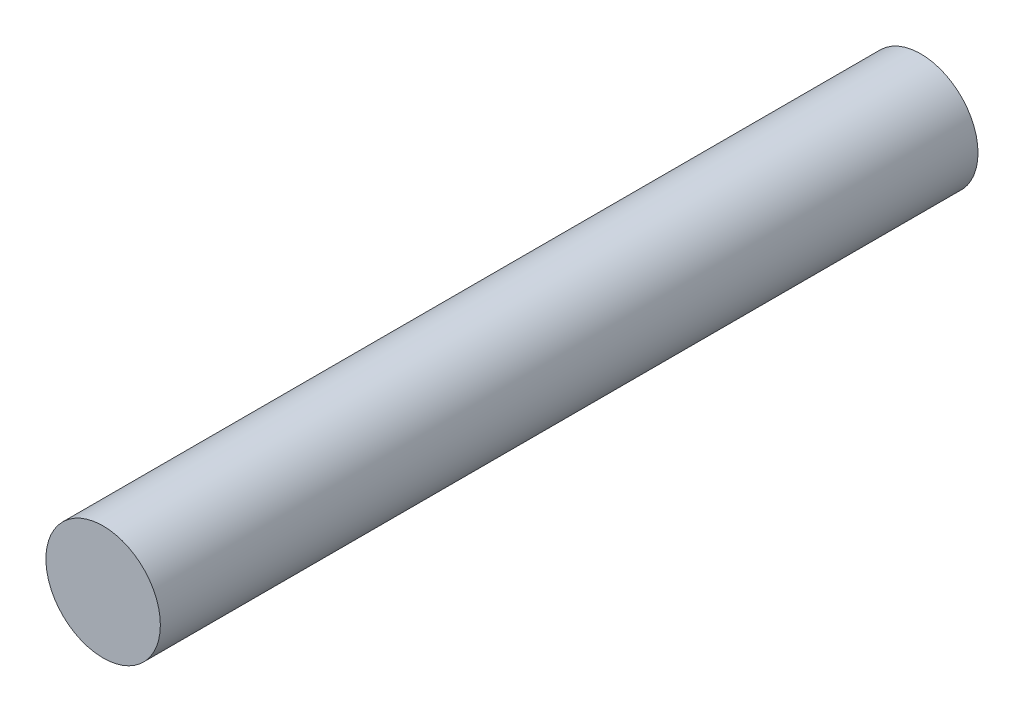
ISO-10303-21;
HEADER;
FILE_DESCRIPTION(('STEP AP214'),'2;1');
FILE_NAME('part.step','',(''),(''),'','','');
FILE_SCHEMA(('AUTOMOTIVE_DESIGN { 1 0 10303 214 1 1 1 1 }'));
ENDSEC;
DATA;
#1=APPLICATION_CONTEXT('core data for automotive mechanical design processes');
#2=APPLICATION_PROTOCOL_DEFINITION('international standard','automotive_design',2000,#1);
#3=PRODUCT_CONTEXT('',#1,'mechanical');
#4=PRODUCT('Part','Part','',(#3));
#5=PRODUCT_RELATED_PRODUCT_CATEGORY('part','',(#4));
#6=PRODUCT_DEFINITION_FORMATION('','',#4);
#7=PRODUCT_DEFINITION_CONTEXT('part definition',#1,'design');
#8=PRODUCT_DEFINITION('design','',#6,#7);
#9=PRODUCT_DEFINITION_SHAPE('','',#8);
#10=(LENGTH_UNIT() NAMED_UNIT(*) SI_UNIT(.MILLI.,.METRE.));
#11=(NAMED_UNIT(*) PLANE_ANGLE_UNIT() SI_UNIT($,.RADIAN.));
#12=(NAMED_UNIT(*) SI_UNIT($,.STERADIAN.) SOLID_ANGLE_UNIT());
#13=UNCERTAINTY_MEASURE_WITH_UNIT(LENGTH_MEASURE(1.E-05),#10,'distance_accuracy_value','');
#14=(GEOMETRIC_REPRESENTATION_CONTEXT(3) GLOBAL_UNCERTAINTY_ASSIGNED_CONTEXT((#13)) GLOBAL_UNIT_ASSIGNED_CONTEXT((#10,
#11,#12)) REPRESENTATION_CONTEXT('',''));
#15=CARTESIAN_POINT('',(0.,0.,0.));
#16=DIRECTION('',(0.,0.,1.));
#17=DIRECTION('',(1.,0.,0.));
#18=AXIS2_PLACEMENT_3D('',#15,#16,#17);
#19=CARTESIAN_POINT('',(0.,0.,750.));
#20=DIRECTION('',(0.,0.,-1.));
#21=DIRECTION('',(-1.,0.,0.));
#22=AXIS2_PLACEMENT_3D('',#19,#20,#21);
#23=CYLINDRICAL_SURFACE('',#22,52.5);
#24=CARTESIAN_POINT('',(0.,0.,750.));
#25=DIRECTION('',(0.,0.,1.));
#26=DIRECTION('',(1.,0.,0.));
#27=AXIS2_PLACEMENT_3D('',#24,#25,#26);
#28=CIRCLE('',#27,52.5);
#29=CARTESIAN_POINT('',(52.5,0.,750.));
#30=VERTEX_POINT('',#29);
#31=EDGE_CURVE('E10',#30,#30,#28,.T.);
#32=ORIENTED_EDGE('',*,*,#31,.F.);
#33=EDGE_LOOP('',(#32));
#34=FACE_BOUND('',#33,.T.);
#35=CARTESIAN_POINT('',(0.,0.,0.));
#36=DIRECTION('',(0.,0.,1.));
#37=DIRECTION('',(1.,0.,0.));
#38=AXIS2_PLACEMENT_3D('',#35,#36,#37);
#39=CIRCLE('',#38,52.5);
#40=CARTESIAN_POINT('',(52.5,0.,0.));
#41=VERTEX_POINT('',#40);
#42=EDGE_CURVE('E34',#41,#41,#39,.T.);
#43=ORIENTED_EDGE('',*,*,#42,.T.);
#44=EDGE_LOOP('',(#43));
#45=FACE_BOUND('',#44,.T.);
#46=ADVANCED_FACE('F31',(#34,#45),#23,.T.);
#47=CARTESIAN_POINT('',(0.,0.,750.));
#48=DIRECTION('',(0.,0.,1.));
#49=DIRECTION('',(1.,0.,0.));
#50=AXIS2_PLACEMENT_3D('',#47,#48,#49);
#51=PLANE('',#50);
#52=ORIENTED_EDGE('',*,*,#31,.T.);
#53=EDGE_LOOP('',(#52));
#54=FACE_BOUND('',#53,.T.);
#55=ADVANCED_FACE('F46',(#54),#51,.T.);
#56=CARTESIAN_POINT('',(0.,0.,0.));
#57=DIRECTION('',(0.,0.,1.));
#58=DIRECTION('',(1.,0.,0.));
#59=AXIS2_PLACEMENT_3D('',#56,#57,#58);
#60=PLANE('',#59);
#61=ORIENTED_EDGE('',*,*,#42,.F.);
#62=EDGE_LOOP('',(#61));
#63=FACE_BOUND('',#62,.T.);
#64=ADVANCED_FACE('F44',(#63),#60,.F.);
#65=CLOSED_SHELL('',(#46,#55,#64));
#66=MANIFOLD_SOLID_BREP('B2',#65);
#67=ADVANCED_BREP_SHAPE_REPRESENTATION('',(#18,#66),#14);
#68=SHAPE_DEFINITION_REPRESENTATION(#9,#67);
ENDSEC;
END-ISO-10303-21;
